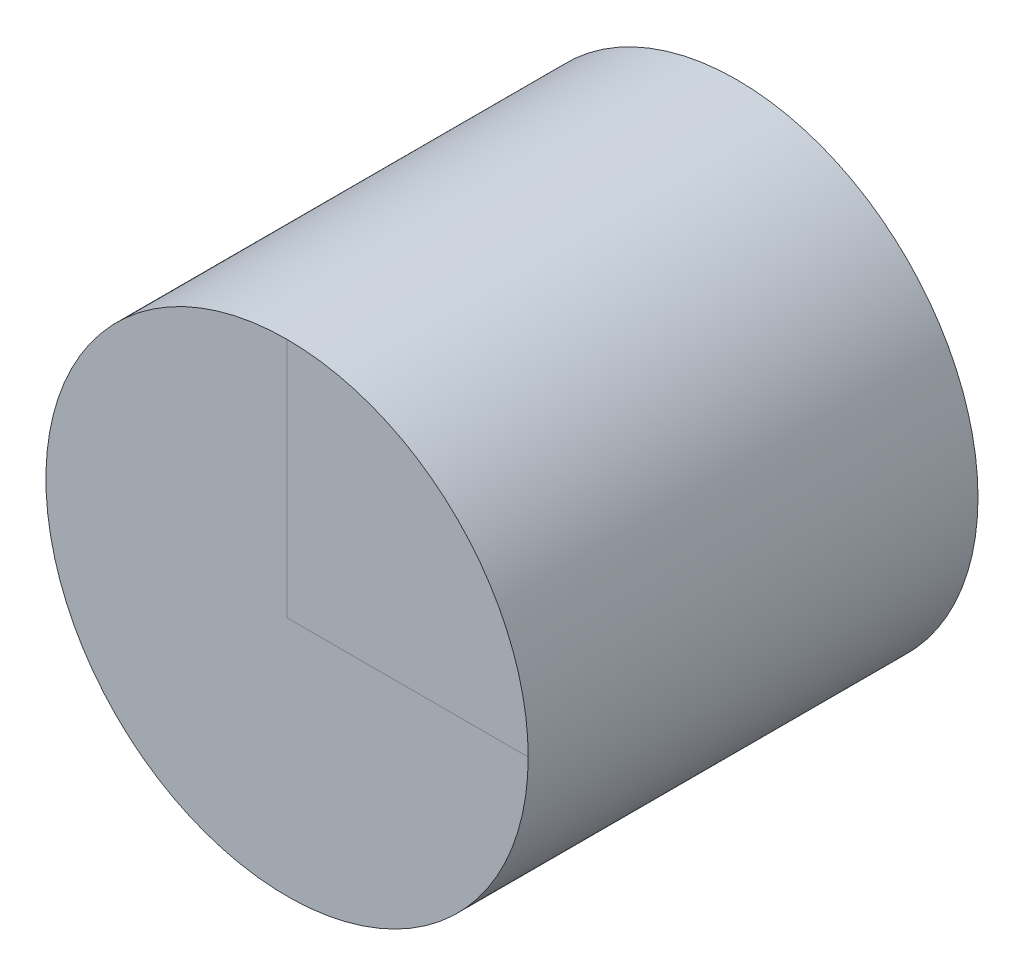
ISO-10303-21;
HEADER;
FILE_DESCRIPTION(('STEP AP214'),'2;1');
FILE_NAME('part.step','',(''),(''),'','','');
FILE_SCHEMA(('AUTOMOTIVE_DESIGN { 1 0 10303 214 1 1 1 1 }'));
ENDSEC;
DATA;
#1=APPLICATION_CONTEXT('core data for automotive mechanical design processes');
#2=APPLICATION_PROTOCOL_DEFINITION('international standard','automotive_design',2000,#1);
#3=PRODUCT_CONTEXT('',#1,'mechanical');
#4=PRODUCT('Part','Part','',(#3));
#5=PRODUCT_RELATED_PRODUCT_CATEGORY('part','',(#4));
#6=PRODUCT_DEFINITION_FORMATION('','',#4);
#7=PRODUCT_DEFINITION_CONTEXT('part definition',#1,'design');
#8=PRODUCT_DEFINITION('design','',#6,#7);
#9=PRODUCT_DEFINITION_SHAPE('','',#8);
#10=(LENGTH_UNIT() NAMED_UNIT(*) SI_UNIT(.MILLI.,.METRE.));
#11=(NAMED_UNIT(*) PLANE_ANGLE_UNIT() SI_UNIT($,.RADIAN.));
#12=(NAMED_UNIT(*) SI_UNIT($,.STERADIAN.) SOLID_ANGLE_UNIT());
#13=UNCERTAINTY_MEASURE_WITH_UNIT(LENGTH_MEASURE(1.E-05),#10,'distance_accuracy_value','');
#14=(GEOMETRIC_REPRESENTATION_CONTEXT(3) GLOBAL_UNCERTAINTY_ASSIGNED_CONTEXT((#13)) GLOBAL_UNIT_ASSIGNED_CONTEXT((#10,
#11,#12)) REPRESENTATION_CONTEXT('',''));
#15=CARTESIAN_POINT('',(0.,0.,0.));
#16=DIRECTION('',(0.,0.,1.));
#17=DIRECTION('',(1.,0.,0.));
#18=AXIS2_PLACEMENT_3D('',#15,#16,#17);
#19=CARTESIAN_POINT('',(0.,0.,0.));
#20=DIRECTION('',(0.,0.,1.));
#21=DIRECTION('',(1.,0.,0.));
#22=AXIS2_PLACEMENT_3D('',#19,#20,#21);
#23=PLANE('',#22);
#24=DIRECTION('',(0.,1.,0.));
#25=VECTOR('',#24,1.);
#26=CARTESIAN_POINT('',(0.,0.,0.));
#27=LINE('',#26,#25);
#28=CARTESIAN_POINT('',(0.,0.,0.));
#29=VERTEX_POINT('',#28);
#30=CARTESIAN_POINT('',(0.,60.,0.));
#31=VERTEX_POINT('',#30);
#32=EDGE_CURVE('E11',#29,#31,#27,.T.);
#33=ORIENTED_EDGE('',*,*,#32,.F.);
#34=DIRECTION('',(-1.,0.,0.));
#35=VECTOR('',#34,1.);
#36=CARTESIAN_POINT('',(0.,0.,0.));
#37=LINE('',#36,#35);
#38=CARTESIAN_POINT('',(60.,0.,0.));
#39=VERTEX_POINT('',#38);
#40=EDGE_CURVE('E44',#39,#29,#37,.T.);
#41=ORIENTED_EDGE('',*,*,#40,.F.);
#42=CARTESIAN_POINT('',(0.,0.,0.));
#43=DIRECTION('',(0.,0.,1.));
#44=DIRECTION('',(1.,0.,0.));
#45=AXIS2_PLACEMENT_3D('',#42,#43,#44);
#46=CIRCLE('',#45,60.);
#47=EDGE_CURVE('E94',#31,#39,#46,.T.);
#48=ORIENTED_EDGE('',*,*,#47,.F.);
#49=EDGE_LOOP('',(#33,#41,#48));
#50=FACE_BOUND('',#49,.T.);
#51=ADVANCED_FACE('F40',(#50),#23,.F.);
#52=CARTESIAN_POINT('',(0.,0.,111.92));
#53=DIRECTION('',(0.,0.,1.));
#54=DIRECTION('',(1.,0.,0.));
#55=AXIS2_PLACEMENT_3D('',#52,#53,#54);
#56=PLANE('',#55);
#57=DIRECTION('',(-1.,0.,0.));
#58=VECTOR('',#57,1.);
#59=CARTESIAN_POINT('',(0.,0.,111.92));
#60=LINE('',#59,#58);
#61=CARTESIAN_POINT('',(60.,0.,111.92));
#62=VERTEX_POINT('',#61);
#63=CARTESIAN_POINT('',(0.,0.,111.92));
#64=VERTEX_POINT('',#63);
#65=EDGE_CURVE('E76',#62,#64,#60,.T.);
#66=ORIENTED_EDGE('',*,*,#65,.T.);
#67=DIRECTION('',(0.,1.,0.));
#68=VECTOR('',#67,1.);
#69=CARTESIAN_POINT('',(0.,0.,111.92));
#70=LINE('',#69,#68);
#71=CARTESIAN_POINT('',(0.,60.,111.92));
#72=VERTEX_POINT('',#71);
#73=EDGE_CURVE('E81',#64,#72,#70,.T.);
#74=ORIENTED_EDGE('',*,*,#73,.T.);
#75=CARTESIAN_POINT('',(0.,0.,111.92));
#76=DIRECTION('',(0.,0.,1.));
#77=DIRECTION('',(1.,0.,0.));
#78=AXIS2_PLACEMENT_3D('',#75,#76,#77);
#79=CIRCLE('',#78,60.);
#80=EDGE_CURVE('E86',#72,#62,#79,.T.);
#81=ORIENTED_EDGE('',*,*,#80,.T.);
#82=EDGE_LOOP('',(#66,#74,#81));
#83=FACE_BOUND('',#82,.T.);
#84=ADVANCED_FACE('F87',(#83),#56,.T.);
#85=CARTESIAN_POINT('',(0.,0.,111.92));
#86=DIRECTION('',(0.,0.,-1.));
#87=DIRECTION('',(-1.,0.,0.));
#88=AXIS2_PLACEMENT_3D('',#85,#86,#87);
#89=CYLINDRICAL_SURFACE('',#88,60.);
#90=EDGE_CURVE('E80',#62,#72,#79,.T.);
#91=ORIENTED_EDGE('',*,*,#90,.F.);
#92=ORIENTED_EDGE('',*,*,#80,.F.);
#93=EDGE_LOOP('',(#91,#92));
#94=FACE_BOUND('',#93,.T.);
#95=EDGE_CURVE('E89',#39,#31,#46,.T.);
#96=ORIENTED_EDGE('',*,*,#95,.T.);
#97=ORIENTED_EDGE('',*,*,#47,.T.);
#98=EDGE_LOOP('',(#96,#97));
#99=FACE_BOUND('',#98,.T.);
#100=ADVANCED_FACE('F42',(#94,#99),#89,.T.);
#101=ORIENTED_EDGE('',*,*,#73,.F.);
#102=ORIENTED_EDGE('',*,*,#65,.F.);
#103=ORIENTED_EDGE('',*,*,#90,.T.);
#104=EDGE_LOOP('',(#101,#102,#103));
#105=FACE_BOUND('',#104,.T.);
#106=ADVANCED_FACE('F78',(#105),#56,.T.);
#107=ORIENTED_EDGE('',*,*,#40,.T.);
#108=ORIENTED_EDGE('',*,*,#32,.T.);
#109=ORIENTED_EDGE('',*,*,#95,.F.);
#110=EDGE_LOOP('',(#107,#108,#109));
#111=FACE_BOUND('',#110,.T.);
#112=ADVANCED_FACE('F102',(#111),#23,.F.);
#113=CLOSED_SHELL('',(#51,#84,#100,#106,#112));
#114=MANIFOLD_SOLID_BREP('B2',#113);
#115=ADVANCED_BREP_SHAPE_REPRESENTATION('',(#18,#114),#14);
#116=SHAPE_DEFINITION_REPRESENTATION(#9,#115);
ENDSEC;
END-ISO-10303-21;
